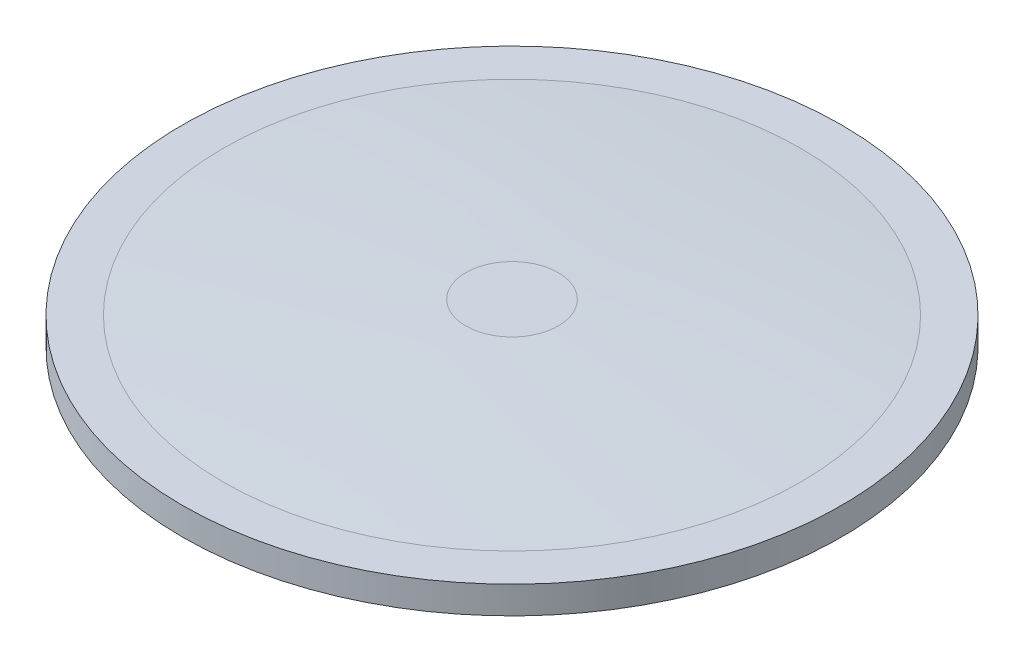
ISO-10303-21;
HEADER;
FILE_DESCRIPTION(('STEP AP214'),'2;1');
FILE_NAME('part.step','',(''),(''),'','','');
FILE_SCHEMA(('AUTOMOTIVE_DESIGN { 1 0 10303 214 1 1 1 1 }'));
ENDSEC;
DATA;
#1=APPLICATION_CONTEXT('core data for automotive mechanical design processes');
#2=APPLICATION_PROTOCOL_DEFINITION('international standard','automotive_design',2000,#1);
#3=PRODUCT_CONTEXT('',#1,'mechanical');
#4=PRODUCT('Part','Part','',(#3));
#5=PRODUCT_RELATED_PRODUCT_CATEGORY('part','',(#4));
#6=PRODUCT_DEFINITION_FORMATION('','',#4);
#7=PRODUCT_DEFINITION_CONTEXT('part definition',#1,'design');
#8=PRODUCT_DEFINITION('design','',#6,#7);
#9=PRODUCT_DEFINITION_SHAPE('','',#8);
#10=(LENGTH_UNIT() NAMED_UNIT(*) SI_UNIT(.MILLI.,.METRE.));
#11=(NAMED_UNIT(*) PLANE_ANGLE_UNIT() SI_UNIT($,.RADIAN.));
#12=(NAMED_UNIT(*) SI_UNIT($,.STERADIAN.) SOLID_ANGLE_UNIT());
#13=UNCERTAINTY_MEASURE_WITH_UNIT(LENGTH_MEASURE(1.E-05),#10,'distance_accuracy_value','');
#14=(GEOMETRIC_REPRESENTATION_CONTEXT(3) GLOBAL_UNCERTAINTY_ASSIGNED_CONTEXT((#13)) GLOBAL_UNIT_ASSIGNED_CONTEXT((#10,
#11,#12)) REPRESENTATION_CONTEXT('',''));
#15=CARTESIAN_POINT('',(0.,0.,0.));
#16=DIRECTION('',(0.,0.,1.));
#17=DIRECTION('',(1.,0.,0.));
#18=AXIS2_PLACEMENT_3D('',#15,#16,#17);
#19=CARTESIAN_POINT('',(0.,3.17500000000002,0.));
#20=DIRECTION('',(0.,-1.,0.));
#21=DIRECTION('',(0.,0.,-1.));
#22=AXIS2_PLACEMENT_3D('',#19,#20,#21);
#23=PLANE('',#22);
#24=CARTESIAN_POINT('',(0.,3.17499999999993,0.));
#25=DIRECTION('',(0.,1.,0.));
#26=DIRECTION('',(0.,0.,1.));
#27=AXIS2_PLACEMENT_3D('',#24,#25,#26);
#28=CIRCLE('',#27,13.9864935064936);
#29=CARTESIAN_POINT('',(0.,3.17499999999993,13.9864935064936));
#30=VERTEX_POINT('',#29);
#31=EDGE_CURVE('E10',#30,#30,#28,.T.);
#32=ORIENTED_EDGE('',*,*,#31,.F.);
#33=EDGE_LOOP('',(#32));
#34=FACE_BOUND('',#33,.T.);
#35=ADVANCED_FACE('F31',(#34),#23,.T.);
#36=CARTESIAN_POINT('',(1.65946657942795E-13,-1002.61835558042,0.));
#37=DIRECTION('',(0.,1.,0.));
#38=DIRECTION('',(0.,0.,1.));
#39=AXIS2_PLACEMENT_3D('',#36,#37,#38);
#40=DEGENERATE_TOROIDAL_SURFACE('',#39,18.2521959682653,1006.30989621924,.F.);
#41=ORIENTED_EDGE('',*,*,#31,.T.);
#42=EDGE_LOOP('',(#41));
#43=FACE_BOUND('',#42,.T.);
#44=CARTESIAN_POINT('',(0.,2.22044604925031E-13,0.));
#45=DIRECTION('',(0.,1.,0.));
#46=DIRECTION('',(0.,0.,1.));
#47=AXIS2_PLACEMENT_3D('',#44,#45,#46);
#48=CIRCLE('',#47,67.8642384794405);
#49=CARTESIAN_POINT('',(0.,2.22051777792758E-13,67.8642384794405));
#50=VERTEX_POINT('',#49);
#51=EDGE_CURVE('E37',#50,#50,#48,.T.);
#52=ORIENTED_EDGE('',*,*,#51,.F.);
#53=EDGE_LOOP('',(#52));
#54=FACE_BOUND('',#53,.T.);
#55=ADVANCED_FACE('F92',(#43,#54),#40,.T.);
#56=CARTESIAN_POINT('',(-1.65946657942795E-13,1002.61835558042,0.));
#57=DIRECTION('',(0.,1.,0.));
#58=DIRECTION('',(0.,0.,1.));
#59=AXIS2_PLACEMENT_3D('',#56,#57,#58);
#60=DEGENERATE_TOROIDAL_SURFACE('',#59,18.2521959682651,1006.30989621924,.F.);
#61=ORIENTED_EDGE('',*,*,#51,.T.);
#62=EDGE_LOOP('',(#61));
#63=FACE_BOUND('',#62,.T.);
#64=CARTESIAN_POINT('',(0.,-3.17500000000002,0.));
#65=DIRECTION('',(0.,1.,0.));
#66=DIRECTION('',(0.,0.,1.));
#67=AXIS2_PLACEMENT_3D('',#64,#65,#66);
#68=CIRCLE('',#67,13.9864935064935);
#69=CARTESIAN_POINT('',(0.,-3.17500000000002,13.9864935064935));
#70=VERTEX_POINT('',#69);
#71=EDGE_CURVE('E41',#70,#70,#68,.T.);
#72=ORIENTED_EDGE('',*,*,#71,.F.);
#73=EDGE_LOOP('',(#72));
#74=FACE_BOUND('',#73,.T.);
#75=ADVANCED_FACE('F87',(#63,#74),#60,.T.);
#76=CARTESIAN_POINT('',(0.,-3.17500000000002,0.));
#77=DIRECTION('',(0.,1.,0.));
#78=DIRECTION('',(0.,0.,1.));
#79=AXIS2_PLACEMENT_3D('',#76,#77,#78);
#80=PLANE('',#79);
#81=CARTESIAN_POINT('',(0.,-3.17500000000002,0.));
#82=DIRECTION('',(0.,1.,0.));
#83=DIRECTION('',(0.,0.,1.));
#84=AXIS2_PLACEMENT_3D('',#81,#82,#83);
#85=CIRCLE('',#84,5.5499);
#86=CARTESIAN_POINT('',(0.,-3.17500000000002,5.5499));
#87=VERTEX_POINT('',#86);
#88=EDGE_CURVE('E68',#87,#87,#85,.F.);
#89=ORIENTED_EDGE('',*,*,#88,.T.);
#90=EDGE_LOOP('',(#89));
#91=FACE_BOUND('',#90,.T.);
#92=ORIENTED_EDGE('',*,*,#71,.T.);
#93=EDGE_LOOP('',(#92));
#94=FACE_BOUND('',#93,.T.);
#95=ADVANCED_FACE('F72',(#91,#94),#80,.T.);
#96=CARTESIAN_POINT('',(0.,-6.35100000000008,0.));
#97=DIRECTION('',(0.,1.,0.));
#98=DIRECTION('',(0.,0.,1.));
#99=AXIS2_PLACEMENT_3D('',#96,#97,#98);
#100=CYLINDRICAL_SURFACE('',#99,5.5499);
#101=CARTESIAN_POINT('',(0.,-6.35000000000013,0.));
#102=DIRECTION('',(0.,-1.,0.));
#103=DIRECTION('',(0.,0.,-1.));
#104=AXIS2_PLACEMENT_3D('',#101,#102,#103);
#105=CIRCLE('',#104,5.5499);
#106=CARTESIAN_POINT('',(0.,-6.35000000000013,-5.5499));
#107=VERTEX_POINT('',#106);
#108=EDGE_CURVE('E65',#107,#107,#105,.F.);
#109=ORIENTED_EDGE('',*,*,#108,.F.);
#110=EDGE_LOOP('',(#109));
#111=FACE_BOUND('',#110,.T.);
#112=ORIENTED_EDGE('',*,*,#88,.F.);
#113=EDGE_LOOP('',(#112));
#114=FACE_BOUND('',#113,.T.);
#115=ADVANCED_FACE('F75',(#111,#114),#100,.F.);
#116=CARTESIAN_POINT('',(0.,-6.35000000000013,0.));
#117=DIRECTION('',(0.,-1.,0.));
#118=DIRECTION('',(0.,0.,-1.));
#119=AXIS2_PLACEMENT_3D('',#116,#117,#118);
#120=PLANE('',#119);
#121=ORIENTED_EDGE('',*,*,#108,.T.);
#122=EDGE_LOOP('',(#121));
#123=FACE_BOUND('',#122,.T.);
#124=CARTESIAN_POINT('',(0.,-6.35000000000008,0.));
#125=DIRECTION('',(0.,1.,0.));
#126=DIRECTION('',(0.,0.,1.));
#127=AXIS2_PLACEMENT_3D('',#124,#125,#126);
#128=CIRCLE('',#127,10.6847668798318);
#129=CARTESIAN_POINT('',(0.,-6.35000000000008,10.6847668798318));
#130=VERTEX_POINT('',#129);
#131=EDGE_CURVE('E45',#130,#130,#128,.T.);
#132=ORIENTED_EDGE('',*,*,#131,.F.);
#133=EDGE_LOOP('',(#132));
#134=FACE_BOUND('',#133,.T.);
#135=ADVANCED_FACE('F77',(#123,#134),#120,.T.);
#136=CARTESIAN_POINT('',(-1.65946657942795E-13,1002.61835558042,0.));
#137=DIRECTION('',(0.,1.,0.));
#138=DIRECTION('',(0.,0.,1.));
#139=AXIS2_PLACEMENT_3D('',#136,#137,#138);
#140=DEGENERATE_TOROIDAL_SURFACE('',#139,18.2521959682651,1009.38322275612,.F.);
#141=ORIENTED_EDGE('',*,*,#131,.T.);
#142=EDGE_LOOP('',(#141));
#143=FACE_BOUND('',#142,.T.);
#144=CARTESIAN_POINT('',(0.,-3.17499999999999,0.));
#145=DIRECTION('',(0.,1.,0.));
#146=DIRECTION('',(0.,0.,1.));
#147=AXIS2_PLACEMENT_3D('',#144,#145,#146);
#148=CIRCLE('',#147,66.802);
#149=CARTESIAN_POINT('',(0.,-3.17499999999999,66.802));
#150=VERTEX_POINT('',#149);
#151=EDGE_CURVE('E50',#150,#150,#148,.T.);
#152=ORIENTED_EDGE('',*,*,#151,.F.);
#153=EDGE_LOOP('',(#152));
#154=FACE_BOUND('',#153,.T.);
#155=ADVANCED_FACE('F84',(#143,#154),#140,.F.);
#156=CARTESIAN_POINT('',(-66.802,-3.17499999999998,0.));
#157=DIRECTION('',(0.,-1.,0.));
#158=DIRECTION('',(0.,0.,-1.));
#159=AXIS2_PLACEMENT_3D('',#156,#157,#158);
#160=PLANE('',#159);
#161=ORIENTED_EDGE('',*,*,#151,.T.);
#162=EDGE_LOOP('',(#161));
#163=FACE_BOUND('',#162,.T.);
#164=CARTESIAN_POINT('',(0.,-3.17499999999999,0.));
#165=DIRECTION('',(0.,1.,0.));
#166=DIRECTION('',(0.,0.,1.));
#167=AXIS2_PLACEMENT_3D('',#164,#165,#166);
#168=CIRCLE('',#167,76.2);
#169=CARTESIAN_POINT('',(0.,-3.17499999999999,76.2));
#170=VERTEX_POINT('',#169);
#171=EDGE_CURVE('E53',#170,#170,#168,.T.);
#172=ORIENTED_EDGE('',*,*,#171,.F.);
#173=EDGE_LOOP('',(#172));
#174=FACE_BOUND('',#173,.T.);
#175=ADVANCED_FACE('F105',(#163,#174),#160,.T.);
#176=CARTESIAN_POINT('',(0.,10.16,0.));
#177=DIRECTION('',(0.,1.,0.));
#178=DIRECTION('',(0.,0.,1.));
#179=AXIS2_PLACEMENT_3D('',#176,#177,#178);
#180=CYLINDRICAL_SURFACE('',#179,76.2);
#181=ORIENTED_EDGE('',*,*,#171,.T.);
#182=EDGE_LOOP('',(#181));
#183=FACE_BOUND('',#182,.T.);
#184=CARTESIAN_POINT('',(0.,3.17499999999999,0.));
#185=DIRECTION('',(0.,1.,0.));
#186=DIRECTION('',(0.,0.,1.));
#187=AXIS2_PLACEMENT_3D('',#184,#185,#186);
#188=CIRCLE('',#187,76.2);
#189=CARTESIAN_POINT('',(0.,3.17499999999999,76.2));
#190=VERTEX_POINT('',#189);
#191=EDGE_CURVE('E56',#190,#190,#188,.T.);
#192=ORIENTED_EDGE('',*,*,#191,.F.);
#193=EDGE_LOOP('',(#192));
#194=FACE_BOUND('',#193,.T.);
#195=ADVANCED_FACE('F109',(#183,#194),#180,.T.);
#196=CARTESIAN_POINT('',(-66.802,3.175,0.));
#197=DIRECTION('',(0.,1.,0.));
#198=DIRECTION('',(0.,0.,1.));
#199=AXIS2_PLACEMENT_3D('',#196,#197,#198);
#200=PLANE('',#199);
#201=ORIENTED_EDGE('',*,*,#191,.T.);
#202=EDGE_LOOP('',(#201));
#203=FACE_BOUND('',#202,.T.);
#204=CARTESIAN_POINT('',(0.,3.17499999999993,0.));
#205=DIRECTION('',(0.,1.,0.));
#206=DIRECTION('',(0.,0.,1.));
#207=AXIS2_PLACEMENT_3D('',#204,#205,#206);
#208=CIRCLE('',#207,66.802);
#209=CARTESIAN_POINT('',(0.,3.17499999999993,66.802));
#210=VERTEX_POINT('',#209);
#211=EDGE_CURVE('E59',#210,#210,#208,.T.);
#212=ORIENTED_EDGE('',*,*,#211,.F.);
#213=EDGE_LOOP('',(#212));
#214=FACE_BOUND('',#213,.T.);
#215=ADVANCED_FACE('F113',(#203,#214),#200,.T.);
#216=CARTESIAN_POINT('',(1.65946657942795E-13,-1002.61835558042,0.));
#217=DIRECTION('',(0.,1.,0.));
#218=DIRECTION('',(0.,0.,1.));
#219=AXIS2_PLACEMENT_3D('',#216,#217,#218);
#220=DEGENERATE_TOROIDAL_SURFACE('',#219,18.2521959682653,1009.38322275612,.F.);
#221=ORIENTED_EDGE('',*,*,#211,.T.);
#222=EDGE_LOOP('',(#221));
#223=FACE_BOUND('',#222,.T.);
#224=CARTESIAN_POINT('',(0.,6.35000000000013,0.));
#225=DIRECTION('',(0.,1.,0.));
#226=DIRECTION('',(0.,0.,1.));
#227=AXIS2_PLACEMENT_3D('',#224,#225,#226);
#228=CIRCLE('',#227,10.6847668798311);
#229=CARTESIAN_POINT('',(0.,6.35000000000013,10.6847668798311));
#230=VERTEX_POINT('',#229);
#231=EDGE_CURVE('E62',#230,#230,#228,.T.);
#232=ORIENTED_EDGE('',*,*,#231,.F.);
#233=EDGE_LOOP('',(#232));
#234=FACE_BOUND('',#233,.T.);
#235=ADVANCED_FACE('F117',(#223,#234),#220,.F.);
#236=CARTESIAN_POINT('',(0.,6.35000000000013,0.));
#237=DIRECTION('',(0.,1.,0.));
#238=DIRECTION('',(0.,0.,1.));
#239=AXIS2_PLACEMENT_3D('',#236,#237,#238);
#240=PLANE('',#239);
#241=ORIENTED_EDGE('',*,*,#231,.T.);
#242=EDGE_LOOP('',(#241));
#243=FACE_BOUND('',#242,.T.);
#244=ADVANCED_FACE('F120',(#243),#240,.T.);
#245=CLOSED_SHELL('',(#35,#55,#75,#95,#115,#135,#155,#175,#195,#215,#235,#244));
#246=MANIFOLD_SOLID_BREP('B2',#245);
#247=ADVANCED_BREP_SHAPE_REPRESENTATION('',(#18,#246),#14);
#248=SHAPE_DEFINITION_REPRESENTATION(#9,#247);
ENDSEC;
END-ISO-10303-21;
